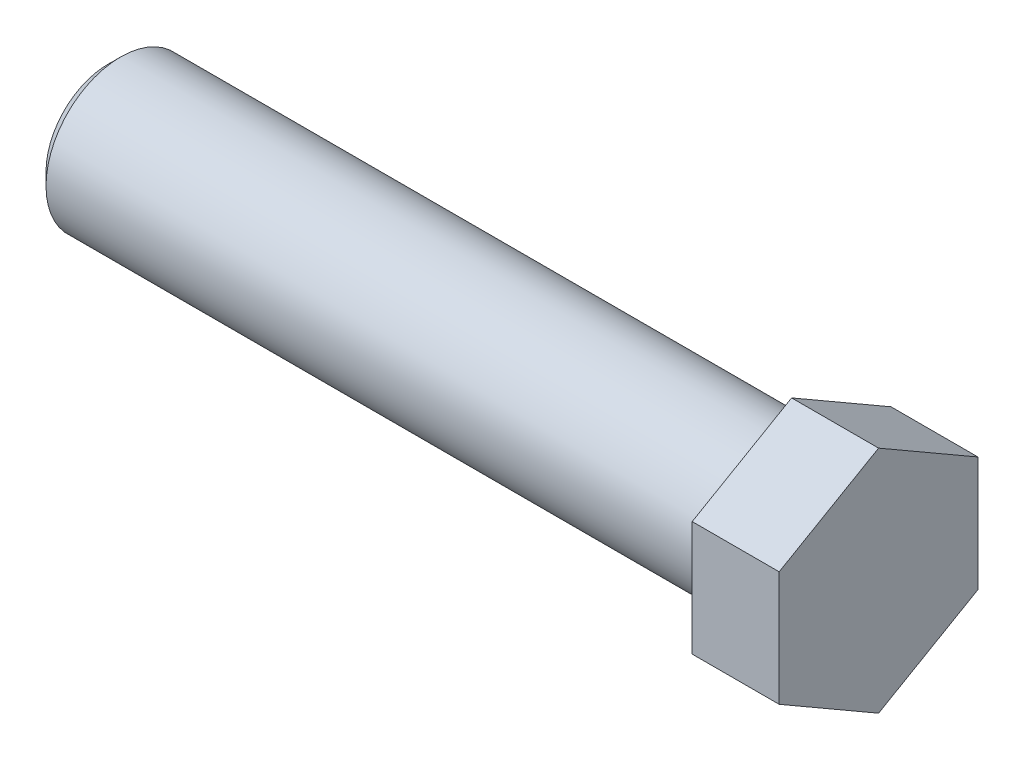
ISO-10303-21;
HEADER;
FILE_DESCRIPTION(('STEP AP214'),'2;1');
FILE_NAME('part.step','',(''),(''),'','','');
FILE_SCHEMA(('AUTOMOTIVE_DESIGN { 1 0 10303 214 1 1 1 1 }'));
ENDSEC;
DATA;
#1=APPLICATION_CONTEXT('core data for automotive mechanical design processes');
#2=APPLICATION_PROTOCOL_DEFINITION('international standard','automotive_design',2000,#1);
#3=PRODUCT_CONTEXT('',#1,'mechanical');
#4=PRODUCT('Part','Part','',(#3));
#5=PRODUCT_RELATED_PRODUCT_CATEGORY('part','',(#4));
#6=PRODUCT_DEFINITION_FORMATION('','',#4);
#7=PRODUCT_DEFINITION_CONTEXT('part definition',#1,'design');
#8=PRODUCT_DEFINITION('design','',#6,#7);
#9=PRODUCT_DEFINITION_SHAPE('','',#8);
#10=(LENGTH_UNIT() NAMED_UNIT(*) SI_UNIT(.MILLI.,.METRE.));
#11=(NAMED_UNIT(*) PLANE_ANGLE_UNIT() SI_UNIT($,.RADIAN.));
#12=(NAMED_UNIT(*) SI_UNIT($,.STERADIAN.) SOLID_ANGLE_UNIT());
#13=UNCERTAINTY_MEASURE_WITH_UNIT(LENGTH_MEASURE(1.E-05),#10,'distance_accuracy_value','');
#14=(GEOMETRIC_REPRESENTATION_CONTEXT(3) GLOBAL_UNCERTAINTY_ASSIGNED_CONTEXT((#13)) GLOBAL_UNIT_ASSIGNED_CONTEXT((#10,
#11,#12)) REPRESENTATION_CONTEXT('',''));
#15=CARTESIAN_POINT('',(0.,0.,0.));
#16=DIRECTION('',(0.,0.,1.));
#17=DIRECTION('',(1.,0.,0.));
#18=AXIS2_PLACEMENT_3D('',#15,#16,#17);
#19=CARTESIAN_POINT('',(30.,0.,0.));
#20=DIRECTION('',(1.,0.,0.));
#21=DIRECTION('',(0.,0.,-1.));
#22=AXIS2_PLACEMENT_3D('',#19,#20,#21);
#23=CYLINDRICAL_SURFACE('',#22,5.99999999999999);
#24=CARTESIAN_POINT('',(-54.,0.,0.));
#25=DIRECTION('',(-1.,0.,0.));
#26=DIRECTION('',(0.,0.,1.));
#27=AXIS2_PLACEMENT_3D('',#24,#25,#26);
#28=CIRCLE('',#27,5.99999999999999);
#29=CARTESIAN_POINT('',(-54.,0.,5.99999999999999));
#30=VERTEX_POINT('',#29);
#31=EDGE_CURVE('E31',#30,#30,#28,.F.);
#32=ORIENTED_EDGE('',*,*,#31,.T.);
#33=EDGE_LOOP('',(#32));
#34=FACE_BOUND('',#33,.T.);
#35=CARTESIAN_POINT('',(0.,0.,0.));
#36=DIRECTION('',(1.,0.,0.));
#37=DIRECTION('',(0.,0.,-1.));
#38=AXIS2_PLACEMENT_3D('',#35,#36,#37);
#39=CIRCLE('',#38,6.);
#40=CARTESIAN_POINT('',(0.,0.,-6.));
#41=VERTEX_POINT('',#40);
#42=EDGE_CURVE('E94',#41,#41,#39,.T.);
#43=ORIENTED_EDGE('',*,*,#42,.F.);
#44=EDGE_LOOP('',(#43));
#45=FACE_BOUND('',#44,.T.);
#46=ADVANCED_FACE('F24',(#34,#45),#23,.T.);
#47=CARTESIAN_POINT('',(-55.,0.,0.));
#48=DIRECTION('',(-1.,0.,0.));
#49=DIRECTION('',(0.,0.,1.));
#50=AXIS2_PLACEMENT_3D('',#47,#48,#49);
#51=PLANE('',#50);
#52=CARTESIAN_POINT('',(-55.,0.,0.));
#53=DIRECTION('',(-1.,0.,0.));
#54=DIRECTION('',(0.,0.,1.));
#55=AXIS2_PLACEMENT_3D('',#52,#53,#54);
#56=CIRCLE('',#55,4.99999999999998);
#57=CARTESIAN_POINT('',(-55.,0.,4.99999999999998));
#58=VERTEX_POINT('',#57);
#59=EDGE_CURVE('E11',#58,#58,#56,.T.);
#60=ORIENTED_EDGE('',*,*,#59,.T.);
#61=EDGE_LOOP('',(#60));
#62=FACE_BOUND('',#61,.T.);
#63=ADVANCED_FACE('F137',(#62),#51,.T.);
#64=CARTESIAN_POINT('',(-54.,0.,0.));
#65=DIRECTION('',(1.,0.,0.));
#66=DIRECTION('',(0.,0.,-1.));
#67=AXIS2_PLACEMENT_3D('',#64,#65,#66);
#68=CONICAL_SURFACE('',#67,5.99999999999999,0.785398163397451);
#69=ORIENTED_EDGE('',*,*,#59,.F.);
#70=EDGE_LOOP('',(#69));
#71=FACE_BOUND('',#70,.T.);
#72=ORIENTED_EDGE('',*,*,#31,.F.);
#73=EDGE_LOOP('',(#72));
#74=FACE_BOUND('',#73,.T.);
#75=ADVANCED_FACE('F135',(#71,#74),#68,.T.);
#76=CARTESIAN_POINT('',(7.,4.61880215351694,-8.));
#77=DIRECTION('',(0.,-0.866025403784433,0.50000000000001));
#78=DIRECTION('',(0.,-0.50000000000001,-0.866025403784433));
#79=AXIS2_PLACEMENT_3D('',#76,#77,#78);
#80=PLANE('',#79);
#81=DIRECTION('',(0.,0.50000000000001,0.866025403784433));
#82=VECTOR('',#81,1.);
#83=CARTESIAN_POINT('',(0.,4.61880215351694,-8.));
#84=LINE('',#83,#82);
#85=CARTESIAN_POINT('',(0.,4.61880215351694,-8.));
#86=VERTEX_POINT('',#85);
#87=CARTESIAN_POINT('',(0.,9.23760430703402,0.));
#88=VERTEX_POINT('',#87);
#89=EDGE_CURVE('E81',#86,#88,#84,.T.);
#90=ORIENTED_EDGE('',*,*,#89,.T.);
#91=DIRECTION('',(-1.,0.,0.));
#92=VECTOR('',#91,1.);
#93=CARTESIAN_POINT('',(7.,9.23760430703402,0.));
#94=LINE('',#93,#92);
#95=CARTESIAN_POINT('',(7.,9.23760430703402,0.));
#96=VERTEX_POINT('',#95);
#97=EDGE_CURVE('E89',#96,#88,#94,.T.);
#98=ORIENTED_EDGE('',*,*,#97,.F.);
#99=DIRECTION('',(0.,0.50000000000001,0.866025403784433));
#100=VECTOR('',#99,1.);
#101=CARTESIAN_POINT('',(7.,4.61880215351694,-8.));
#102=LINE('',#101,#100);
#103=CARTESIAN_POINT('',(7.,4.61880215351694,-8.));
#104=VERTEX_POINT('',#103);
#105=EDGE_CURVE('E109',#104,#96,#102,.T.);
#106=ORIENTED_EDGE('',*,*,#105,.F.);
#107=DIRECTION('',(-1.,0.,0.));
#108=VECTOR('',#107,1.);
#109=CARTESIAN_POINT('',(7.,4.61880215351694,-8.));
#110=LINE('',#109,#108);
#111=EDGE_CURVE('E99',#104,#86,#110,.T.);
#112=ORIENTED_EDGE('',*,*,#111,.T.);
#113=EDGE_LOOP('',(#90,#98,#106,#112));
#114=FACE_BOUND('',#113,.T.);
#115=ADVANCED_FACE('F98',(#114),#80,.F.);
#116=CARTESIAN_POINT('',(7.,9.23760430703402,0.));
#117=DIRECTION('',(0.,-0.866025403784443,-0.499999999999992));
#118=DIRECTION('',(0.,0.499999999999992,-0.866025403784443));
#119=AXIS2_PLACEMENT_3D('',#116,#117,#118);
#120=PLANE('',#119);
#121=DIRECTION('',(0.,-0.499999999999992,0.866025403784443));
#122=VECTOR('',#121,1.);
#123=CARTESIAN_POINT('',(0.,9.23760430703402,0.));
#124=LINE('',#123,#122);
#125=CARTESIAN_POINT('',(0.,4.61880215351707,7.99999999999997));
#126=VERTEX_POINT('',#125);
#127=EDGE_CURVE('E76',#88,#126,#124,.T.);
#128=ORIENTED_EDGE('',*,*,#127,.T.);
#129=DIRECTION('',(-1.,0.,0.));
#130=VECTOR('',#129,1.);
#131=CARTESIAN_POINT('',(7.,4.61880215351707,7.99999999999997));
#132=LINE('',#131,#130);
#133=CARTESIAN_POINT('',(7.,4.61880215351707,7.99999999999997));
#134=VERTEX_POINT('',#133);
#135=EDGE_CURVE('E95',#134,#126,#132,.T.);
#136=ORIENTED_EDGE('',*,*,#135,.F.);
#137=DIRECTION('',(0.,-0.499999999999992,0.866025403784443));
#138=VECTOR('',#137,1.);
#139=CARTESIAN_POINT('',(7.,9.23760430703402,0.));
#140=LINE('',#139,#138);
#141=EDGE_CURVE('E91',#96,#134,#140,.T.);
#142=ORIENTED_EDGE('',*,*,#141,.F.);
#143=ORIENTED_EDGE('',*,*,#97,.T.);
#144=EDGE_LOOP('',(#128,#136,#142,#143));
#145=FACE_BOUND('',#144,.T.);
#146=ADVANCED_FACE('F90',(#145),#120,.F.);
#147=CARTESIAN_POINT('',(7.,4.61880215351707,7.99999999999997));
#148=DIRECTION('',(0.,0.,-1.));
#149=DIRECTION('',(0.,1.,0.));
#150=AXIS2_PLACEMENT_3D('',#147,#148,#149);
#151=PLANE('',#150);
#152=DIRECTION('',(0.,-1.,0.));
#153=VECTOR('',#152,1.);
#154=CARTESIAN_POINT('',(0.,4.61880215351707,7.99999999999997));
#155=LINE('',#154,#153);
#156=CARTESIAN_POINT('',(0.,-4.61880215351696,8.00000000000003));
#157=VERTEX_POINT('',#156);
#158=EDGE_CURVE('E83',#126,#157,#155,.T.);
#159=ORIENTED_EDGE('',*,*,#158,.T.);
#160=DIRECTION('',(-1.,0.,0.));
#161=VECTOR('',#160,1.);
#162=CARTESIAN_POINT('',(7.,-4.61880215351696,8.00000000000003));
#163=LINE('',#162,#161);
#164=CARTESIAN_POINT('',(7.,-4.61880215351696,8.00000000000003));
#165=VERTEX_POINT('',#164);
#166=EDGE_CURVE('E125',#165,#157,#163,.T.);
#167=ORIENTED_EDGE('',*,*,#166,.F.);
#168=DIRECTION('',(0.,-1.,0.));
#169=VECTOR('',#168,1.);
#170=CARTESIAN_POINT('',(7.,4.61880215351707,7.99999999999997));
#171=LINE('',#170,#169);
#172=EDGE_CURVE('E112',#134,#165,#171,.T.);
#173=ORIENTED_EDGE('',*,*,#172,.F.);
#174=ORIENTED_EDGE('',*,*,#135,.T.);
#175=EDGE_LOOP('',(#159,#167,#173,#174));
#176=FACE_BOUND('',#175,.T.);
#177=ADVANCED_FACE('F167',(#176),#151,.F.);
#178=CARTESIAN_POINT('',(7.,-4.61880215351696,8.00000000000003));
#179=DIRECTION('',(0.,0.866025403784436,-0.500000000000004));
#180=DIRECTION('',(0.,0.500000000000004,0.866025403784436));
#181=AXIS2_PLACEMENT_3D('',#178,#179,#180);
#182=PLANE('',#181);
#183=DIRECTION('',(0.,-0.500000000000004,-0.866025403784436));
#184=VECTOR('',#183,1.);
#185=CARTESIAN_POINT('',(0.,-4.61880215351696,8.00000000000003));
#186=LINE('',#185,#184);
#187=CARTESIAN_POINT('',(0.,-9.23760430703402,0.));
#188=VERTEX_POINT('',#187);
#189=EDGE_CURVE('E103',#157,#188,#186,.T.);
#190=ORIENTED_EDGE('',*,*,#189,.T.);
#191=DIRECTION('',(-1.,0.,0.));
#192=VECTOR('',#191,1.);
#193=CARTESIAN_POINT('',(7.,-9.23760430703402,0.));
#194=LINE('',#193,#192);
#195=CARTESIAN_POINT('',(7.,-9.23760430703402,0.));
#196=VERTEX_POINT('',#195);
#197=EDGE_CURVE('E122',#196,#188,#194,.T.);
#198=ORIENTED_EDGE('',*,*,#197,.F.);
#199=DIRECTION('',(0.,-0.500000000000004,-0.866025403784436));
#200=VECTOR('',#199,1.);
#201=CARTESIAN_POINT('',(7.,-4.61880215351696,8.00000000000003));
#202=LINE('',#201,#200);
#203=EDGE_CURVE('E114',#165,#196,#202,.T.);
#204=ORIENTED_EDGE('',*,*,#203,.F.);
#205=ORIENTED_EDGE('',*,*,#166,.T.);
#206=EDGE_LOOP('',(#190,#198,#204,#205));
#207=FACE_BOUND('',#206,.T.);
#208=ADVANCED_FACE('F174',(#207),#182,.F.);
#209=CARTESIAN_POINT('',(7.,-9.23760430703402,0.));
#210=DIRECTION('',(0.,0.86602540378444,0.499999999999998));
#211=DIRECTION('',(0.,-0.499999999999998,0.86602540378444));
#212=AXIS2_PLACEMENT_3D('',#209,#210,#211);
#213=PLANE('',#212);
#214=DIRECTION('',(0.,0.499999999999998,-0.86602540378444));
#215=VECTOR('',#214,1.);
#216=CARTESIAN_POINT('',(0.,-9.23760430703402,0.));
#217=LINE('',#216,#215);
#218=CARTESIAN_POINT('',(0.,-4.61880215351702,-8.));
#219=VERTEX_POINT('',#218);
#220=EDGE_CURVE('E105',#188,#219,#217,.T.);
#221=ORIENTED_EDGE('',*,*,#220,.T.);
#222=DIRECTION('',(-1.,0.,0.));
#223=VECTOR('',#222,1.);
#224=CARTESIAN_POINT('',(7.,-4.61880215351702,-8.));
#225=LINE('',#224,#223);
#226=CARTESIAN_POINT('',(7.,-4.61880215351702,-8.));
#227=VERTEX_POINT('',#226);
#228=EDGE_CURVE('E119',#227,#219,#225,.T.);
#229=ORIENTED_EDGE('',*,*,#228,.F.);
#230=DIRECTION('',(0.,0.499999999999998,-0.86602540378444));
#231=VECTOR('',#230,1.);
#232=CARTESIAN_POINT('',(7.,-9.23760430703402,0.));
#233=LINE('',#232,#231);
#234=EDGE_CURVE('E43',#196,#227,#233,.T.);
#235=ORIENTED_EDGE('',*,*,#234,.F.);
#236=ORIENTED_EDGE('',*,*,#197,.T.);
#237=EDGE_LOOP('',(#221,#229,#235,#236));
#238=FACE_BOUND('',#237,.T.);
#239=ADVANCED_FACE('F182',(#238),#213,.F.);
#240=CARTESIAN_POINT('',(7.,-4.61880215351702,-8.));
#241=DIRECTION('',(0.,0.,1.));
#242=DIRECTION('',(1.,0.,0.));
#243=AXIS2_PLACEMENT_3D('',#240,#241,#242);
#244=PLANE('',#243);
#245=DIRECTION('',(0.,1.,0.));
#246=VECTOR('',#245,1.);
#247=CARTESIAN_POINT('',(0.,-4.61880215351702,-8.));
#248=LINE('',#247,#246);
#249=EDGE_CURVE('E107',#219,#86,#248,.T.);
#250=ORIENTED_EDGE('',*,*,#249,.T.);
#251=ORIENTED_EDGE('',*,*,#111,.F.);
#252=DIRECTION('',(0.,1.,0.));
#253=VECTOR('',#252,1.);
#254=CARTESIAN_POINT('',(7.,-4.61880215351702,-8.));
#255=LINE('',#254,#253);
#256=EDGE_CURVE('E38',#227,#104,#255,.T.);
#257=ORIENTED_EDGE('',*,*,#256,.F.);
#258=ORIENTED_EDGE('',*,*,#228,.T.);
#259=EDGE_LOOP('',(#250,#251,#257,#258));
#260=FACE_BOUND('',#259,.T.);
#261=ADVANCED_FACE('F190',(#260),#244,.F.);
#262=CARTESIAN_POINT('',(7.,-1.14491749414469E-13,-15.9999999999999));
#263=DIRECTION('',(-1.,0.,0.));
#264=DIRECTION('',(0.,0.,1.));
#265=AXIS2_PLACEMENT_3D('',#262,#263,#264);
#266=PLANE('',#265);
#267=ORIENTED_EDGE('',*,*,#105,.T.);
#268=ORIENTED_EDGE('',*,*,#141,.T.);
#269=ORIENTED_EDGE('',*,*,#172,.T.);
#270=ORIENTED_EDGE('',*,*,#203,.T.);
#271=ORIENTED_EDGE('',*,*,#234,.T.);
#272=ORIENTED_EDGE('',*,*,#256,.T.);
#273=EDGE_LOOP('',(#267,#268,#269,#270,#271,#272));
#274=FACE_BOUND('',#273,.T.);
#275=ADVANCED_FACE('F198',(#274),#266,.F.);
#276=CARTESIAN_POINT('',(0.,-1.14491749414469E-13,-15.9999999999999));
#277=DIRECTION('',(-1.,0.,0.));
#278=DIRECTION('',(0.,0.,1.));
#279=AXIS2_PLACEMENT_3D('',#276,#277,#278);
#280=PLANE('',#279);
#281=ORIENTED_EDGE('',*,*,#42,.T.);
#282=EDGE_LOOP('',(#281));
#283=FACE_BOUND('',#282,.T.);
#284=ORIENTED_EDGE('',*,*,#89,.F.);
#285=ORIENTED_EDGE('',*,*,#249,.F.);
#286=ORIENTED_EDGE('',*,*,#220,.F.);
#287=ORIENTED_EDGE('',*,*,#189,.F.);
#288=ORIENTED_EDGE('',*,*,#158,.F.);
#289=ORIENTED_EDGE('',*,*,#127,.F.);
#290=EDGE_LOOP('',(#284,#285,#286,#287,#288,#289));
#291=FACE_BOUND('',#290,.T.);
#292=ADVANCED_FACE('F78',(#283,#291),#280,.T.);
#293=CLOSED_SHELL('',(#46,#63,#75,#115,#146,#177,#208,#239,#261,#275,#292));
#294=MANIFOLD_SOLID_BREP('B2',#293);
#295=ADVANCED_BREP_SHAPE_REPRESENTATION('',(#18,#294),#14);
#296=SHAPE_DEFINITION_REPRESENTATION(#9,#295);
ENDSEC;
END-ISO-10303-21;
